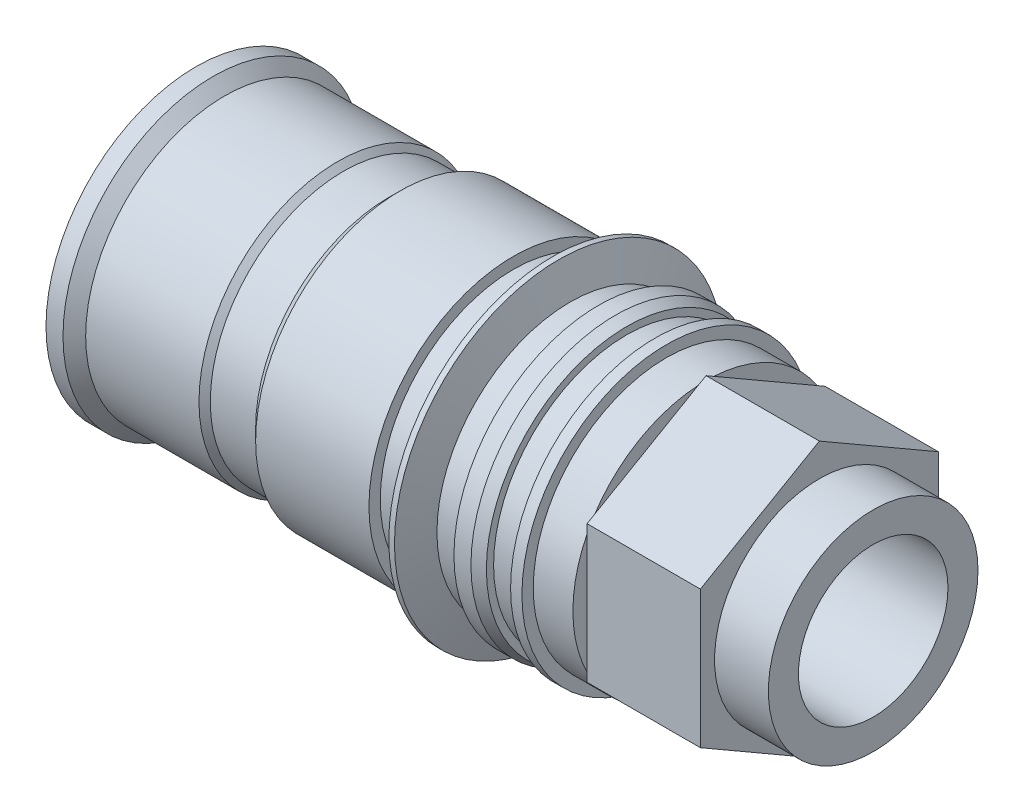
from build123d import *

# Parameters (mm, degrees)
SALIENTE_EXTRUIR1_DEPTH = 20
CROQUIS3_R              = 18.5
SALIENTE_EXTRUIR2_DEPTH = 9.5
CROQUIS4_R              = 13.2
CORTAR_EXTRUIR1_DEPTH   = 127.339482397


with BuildPart() as part:
    # Croquis1 → Revoluci_n1 (revolve)
    with BuildSketch(Plane.XY, mode=Mode.PRIVATE) as revoluci_n1_sk:
        Polygon((0, 0), (0, 26.5), (3, 26.5), (5, 24.5), (25, 24.5), (26, 23.5), (34, 23.5), (36, 25.5), (56, 25.5), (56, 23.5), (61, 23.5), (63, 28.994954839), (64, 28.994954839), (66, 23.5), (71, 23.5), (71, 25.5), (74, 25.5), (76, 24.772059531), (76, 23.5), (81, 23.5), (81, 25.5), (83, 25.5), (83, 23.5), (90, 23.5), (90, 0), align=None)
    revolve(revoluci_n1_sk.sketch.rotate(Axis((0, 0, 0), (1, 0, 0)), 90), axis=Axis((0, 0, 0), (1, 0, 0)))

    # Croquis2 → Saliente-Extruir1 (add)
    with BuildSketch(Plane(origin=(90, 0, 0), x_dir=(0, 0, -1), z_dir=(1, 0, 0))):
        Polygon((0, 24.248711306), (-21, 12.124355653), (-21, -12.124355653), (0, -24.248711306), (21, -12.124355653), (21, 12.124355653), align=None)
    extrude(amount=SALIENTE_EXTRUIR1_DEPTH)

    # Croquis3 → Saliente-Extruir2 (add)
    with BuildSketch(Plane(origin=(110, 0, 0), x_dir=(0, 0, -1), z_dir=(1, 0, 0))):
        Circle(CROQUIS3_R)
    extrude(amount=SALIENTE_EXTRUIR2_DEPTH)

    # Croquis4 → Cortar-Extruir1 (cut, through all)
    with BuildSketch(Plane(origin=(119.5, 0, 0), x_dir=(0, 0, -1), z_dir=(1, 0, 0))):
        Circle(CROQUIS4_R)
    extrude(amount=-CORTAR_EXTRUIR1_DEPTH, mode=Mode.SUBTRACT)


solid = part.part
